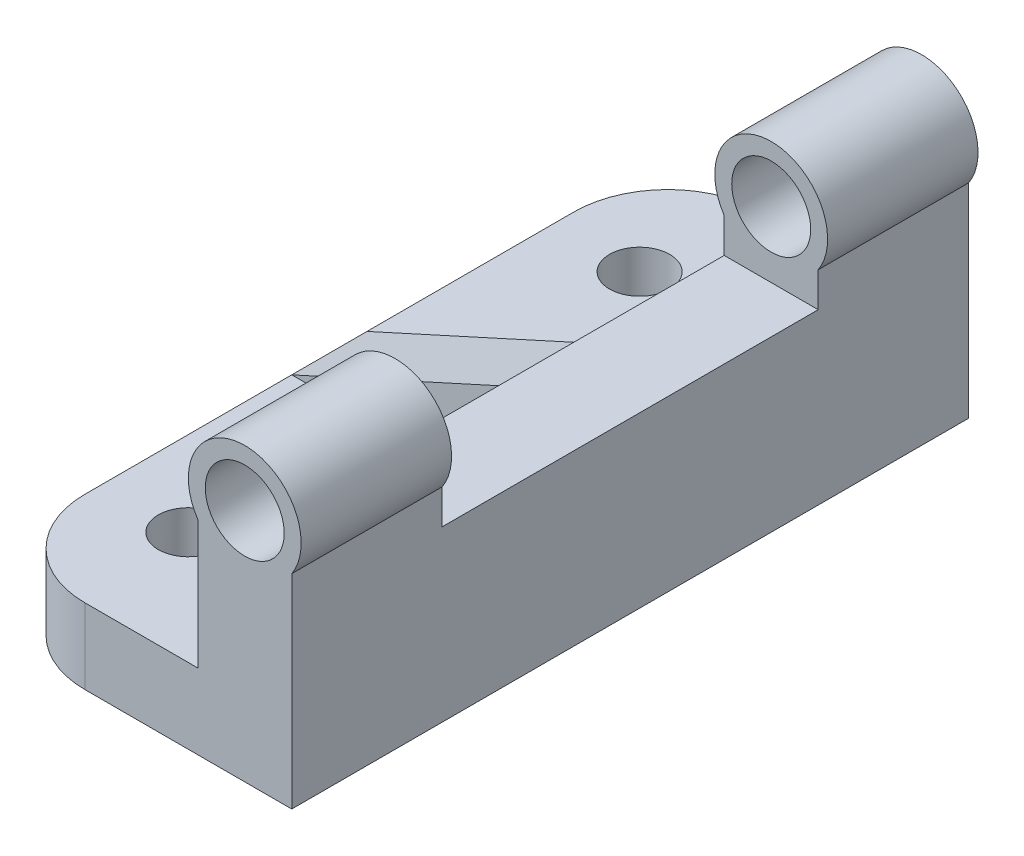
ISO-10303-21;
HEADER;
FILE_DESCRIPTION(('STEP AP214'),'2;1');
FILE_NAME('part.step','',(''),(''),'','','');
FILE_SCHEMA(('AUTOMOTIVE_DESIGN { 1 0 10303 214 1 1 1 1 }'));
ENDSEC;
DATA;
#1=APPLICATION_CONTEXT('core data for automotive mechanical design processes');
#2=APPLICATION_PROTOCOL_DEFINITION('international standard','automotive_design',2000,#1);
#3=PRODUCT_CONTEXT('',#1,'mechanical');
#4=PRODUCT('Part','Part','',(#3));
#5=PRODUCT_RELATED_PRODUCT_CATEGORY('part','',(#4));
#6=PRODUCT_DEFINITION_FORMATION('','',#4);
#7=PRODUCT_DEFINITION_CONTEXT('part definition',#1,'design');
#8=PRODUCT_DEFINITION('design','',#6,#7);
#9=PRODUCT_DEFINITION_SHAPE('','',#8);
#10=(LENGTH_UNIT() NAMED_UNIT(*) SI_UNIT(.MILLI.,.METRE.));
#11=(NAMED_UNIT(*) PLANE_ANGLE_UNIT() SI_UNIT($,.RADIAN.));
#12=(NAMED_UNIT(*) SI_UNIT($,.STERADIAN.) SOLID_ANGLE_UNIT());
#13=UNCERTAINTY_MEASURE_WITH_UNIT(LENGTH_MEASURE(1.E-05),#10,'distance_accuracy_value','');
#14=(GEOMETRIC_REPRESENTATION_CONTEXT(3) GLOBAL_UNCERTAINTY_ASSIGNED_CONTEXT((#13)) GLOBAL_UNIT_ASSIGNED_CONTEXT((#10,
#11,#12)) REPRESENTATION_CONTEXT('',''));
#15=CARTESIAN_POINT('',(0.,0.,0.));
#16=DIRECTION('',(0.,0.,1.));
#17=DIRECTION('',(1.,0.,0.));
#18=AXIS2_PLACEMENT_3D('',#15,#16,#17);
#19=CARTESIAN_POINT('',(0.,12.5,0.));
#20=DIRECTION('',(1.,0.,0.));
#21=DIRECTION('',(0.,0.,-1.));
#22=AXIS2_PLACEMENT_3D('',#19,#20,#21);
#23=PLANE('',#22);
#24=DIRECTION('',(0.,1.,0.));
#25=VECTOR('',#24,1.);
#26=CARTESIAN_POINT('',(0.,4.,2.));
#27=LINE('',#26,#25);
#28=CARTESIAN_POINT('',(0.,4.,2.));
#29=VERTEX_POINT('',#28);
#30=CARTESIAN_POINT('',(0.,9.00000000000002,2.));
#31=VERTEX_POINT('',#30);
#32=EDGE_CURVE('E174',#29,#31,#27,.T.);
#33=ORIENTED_EDGE('',*,*,#32,.F.);
#34=DIRECTION('',(0.,0.,1.));
#35=VECTOR('',#34,1.);
#36=CARTESIAN_POINT('',(0.,4.,0.));
#37=LINE('',#36,#35);
#38=CARTESIAN_POINT('',(0.,4.,18.));
#39=VERTEX_POINT('',#38);
#40=EDGE_CURVE('E180',#29,#39,#37,.T.);
#41=ORIENTED_EDGE('',*,*,#40,.T.);
#42=DIRECTION('',(0.,-1.,0.));
#43=VECTOR('',#42,1.);
#44=CARTESIAN_POINT('',(0.,12.5,18.));
#45=LINE('',#44,#43);
#46=CARTESIAN_POINT('',(0.,10.8416876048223,18.));
#47=VERTEX_POINT('',#46);
#48=EDGE_CURVE('E265',#47,#39,#45,.T.);
#49=ORIENTED_EDGE('',*,*,#48,.F.);
#50=DIRECTION('',(0.,0.,1.));
#51=VECTOR('',#50,1.);
#52=CARTESIAN_POINT('',(0.,10.8416876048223,-18.));
#53=LINE('',#52,#51);
#54=CARTESIAN_POINT('',(0.,10.8416876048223,10.));
#55=VERTEX_POINT('',#54);
#56=EDGE_CURVE('E272',#47,#55,#53,.F.);
#57=ORIENTED_EDGE('',*,*,#56,.T.);
#58=DIRECTION('',(0.,-1.,0.));
#59=VECTOR('',#58,1.);
#60=CARTESIAN_POINT('',(0.,12.5,10.));
#61=LINE('',#60,#59);
#62=CARTESIAN_POINT('',(0.,9.00000000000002,10.));
#63=VERTEX_POINT('',#62);
#64=EDGE_CURVE('E210',#55,#63,#61,.T.);
#65=ORIENTED_EDGE('',*,*,#64,.T.);
#66=DIRECTION('',(0.,0.,1.));
#67=VECTOR('',#66,1.);
#68=CARTESIAN_POINT('',(0.,9.00000000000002,0.));
#69=LINE('',#68,#67);
#70=EDGE_CURVE('E275',#31,#63,#69,.T.);
#71=ORIENTED_EDGE('',*,*,#70,.F.);
#72=EDGE_LOOP('',(#33,#41,#49,#57,#65,#71));
#73=FACE_BOUND('',#72,.T.);
#74=ADVANCED_FACE('F38',(#73),#23,.F.);
#75=CARTESIAN_POINT('',(0.,4.,0.));
#76=DIRECTION('',(0.,1.,0.));
#77=DIRECTION('',(0.,0.,1.));
#78=AXIS2_PLACEMENT_3D('',#75,#76,#77);
#79=PLANE('',#78);
#80=CARTESIAN_POINT('',(-6.5,4.,12.));
#81=DIRECTION('',(0.,1.,0.));
#82=DIRECTION('',(0.,0.,1.));
#83=AXIS2_PLACEMENT_3D('',#80,#81,#82);
#84=CIRCLE('',#83,1.6);
#85=CARTESIAN_POINT('',(-6.5,4.,13.6));
#86=VERTEX_POINT('',#85);
#87=EDGE_CURVE('E232',#86,#86,#84,.T.);
#88=ORIENTED_EDGE('',*,*,#87,.F.);
#89=EDGE_LOOP('',(#88));
#90=FACE_BOUND('',#89,.T.);
#91=DIRECTION('',(0.,0.,-1.));
#92=VECTOR('',#91,1.);
#93=CARTESIAN_POINT('',(-11.,4.,-18.));
#94=LINE('',#93,#92);
#95=CARTESIAN_POINT('',(-11.,4.,13.));
#96=VERTEX_POINT('',#95);
#97=CARTESIAN_POINT('',(-11.,4.,2.));
#98=VERTEX_POINT('',#97);
#99=EDGE_CURVE('E144',#96,#98,#94,.T.);
#100=ORIENTED_EDGE('',*,*,#99,.F.);
#101=CARTESIAN_POINT('',(-6.,4.,13.));
#102=DIRECTION('',(0.,1.,0.));
#103=DIRECTION('',(0.,0.,1.));
#104=AXIS2_PLACEMENT_3D('',#101,#102,#103);
#105=CIRCLE('',#104,5.);
#106=CARTESIAN_POINT('',(-6.,4.,18.));
#107=VERTEX_POINT('',#106);
#108=EDGE_CURVE('E291',#96,#107,#105,.T.);
#109=ORIENTED_EDGE('',*,*,#108,.T.);
#110=DIRECTION('',(-1.,0.,0.));
#111=VECTOR('',#110,1.);
#112=CARTESIAN_POINT('',(-11.,4.,18.));
#113=LINE('',#112,#111);
#114=EDGE_CURVE('E245',#39,#107,#113,.T.);
#115=ORIENTED_EDGE('',*,*,#114,.F.);
#116=ORIENTED_EDGE('',*,*,#40,.F.);
#117=DIRECTION('',(1.,0.,0.));
#118=VECTOR('',#117,1.);
#119=CARTESIAN_POINT('',(-11.,4.,2.));
#120=LINE('',#119,#118);
#121=EDGE_CURVE('E172',#98,#29,#120,.T.);
#122=ORIENTED_EDGE('',*,*,#121,.F.);
#123=EDGE_LOOP('',(#100,#109,#115,#116,#122));
#124=FACE_BOUND('',#123,.T.);
#125=ADVANCED_FACE('F178',(#90,#124),#79,.T.);
#126=CARTESIAN_POINT('',(2.5,12.5,-18.));
#127=DIRECTION('',(0.,0.,1.));
#128=DIRECTION('',(1.,0.,0.));
#129=AXIS2_PLACEMENT_3D('',#126,#127,#128);
#130=CYLINDRICAL_SURFACE('',#129,3.);
#131=CARTESIAN_POINT('',(2.5,12.5,10.));
#132=DIRECTION('',(0.,0.,1.));
#133=DIRECTION('',(1.,0.,0.));
#134=AXIS2_PLACEMENT_3D('',#131,#132,#133);
#135=CIRCLE('',#134,3.);
#136=CARTESIAN_POINT('',(5.,10.8416876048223,10.));
#137=VERTEX_POINT('',#136);
#138=EDGE_CURVE('E208',#55,#137,#135,.F.);
#139=ORIENTED_EDGE('',*,*,#138,.F.);
#140=ORIENTED_EDGE('',*,*,#56,.F.);
#141=CARTESIAN_POINT('',(2.5,12.5,18.));
#142=DIRECTION('',(0.,0.,1.));
#143=DIRECTION('',(1.,0.,0.));
#144=AXIS2_PLACEMENT_3D('',#141,#142,#143);
#145=CIRCLE('',#144,3.);
#146=CARTESIAN_POINT('',(5.,10.8416876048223,18.));
#147=VERTEX_POINT('',#146);
#148=EDGE_CURVE('E226',#147,#47,#145,.T.);
#149=ORIENTED_EDGE('',*,*,#148,.F.);
#150=DIRECTION('',(0.,0.,1.));
#151=VECTOR('',#150,1.);
#152=CARTESIAN_POINT('',(5.,10.8416876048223,-18.));
#153=LINE('',#152,#151);
#154=EDGE_CURVE('E225',#137,#147,#153,.T.);
#155=ORIENTED_EDGE('',*,*,#154,.F.);
#156=EDGE_LOOP('',(#139,#140,#149,#155));
#157=FACE_BOUND('',#156,.T.);
#158=ADVANCED_FACE('F313',(#157),#130,.T.);
#159=CARTESIAN_POINT('',(2.5,12.5,-21.));
#160=DIRECTION('',(0.,0.,1.));
#161=DIRECTION('',(1.,0.,0.));
#162=AXIS2_PLACEMENT_3D('',#159,#160,#161);
#163=CYLINDRICAL_SURFACE('',#162,2.1);
#164=CARTESIAN_POINT('',(2.5,12.5,10.));
#165=DIRECTION('',(0.,0.,1.));
#166=DIRECTION('',(1.,0.,0.));
#167=AXIS2_PLACEMENT_3D('',#164,#165,#166);
#168=CIRCLE('',#167,2.1);
#169=CARTESIAN_POINT('',(4.6,12.5,10.));
#170=VERTEX_POINT('',#169);
#171=EDGE_CURVE('E207',#170,#170,#168,.F.);
#172=ORIENTED_EDGE('',*,*,#171,.T.);
#173=EDGE_LOOP('',(#172));
#174=FACE_BOUND('',#173,.T.);
#175=CARTESIAN_POINT('',(2.5,12.5,18.));
#176=DIRECTION('',(0.,0.,1.));
#177=DIRECTION('',(1.,0.,0.));
#178=AXIS2_PLACEMENT_3D('',#175,#176,#177);
#179=CIRCLE('',#178,2.1);
#180=CARTESIAN_POINT('',(4.6,12.5,18.));
#181=VERTEX_POINT('',#180);
#182=EDGE_CURVE('E218',#181,#181,#179,.T.);
#183=ORIENTED_EDGE('',*,*,#182,.T.);
#184=EDGE_LOOP('',(#183));
#185=FACE_BOUND('',#184,.T.);
#186=ADVANCED_FACE('F375',(#174,#185),#163,.F.);
#187=CARTESIAN_POINT('',(5.,12.5,18.));
#188=DIRECTION('',(0.,0.,-1.));
#189=DIRECTION('',(-1.,0.,0.));
#190=AXIS2_PLACEMENT_3D('',#187,#188,#189);
#191=PLANE('',#190);
#192=ORIENTED_EDGE('',*,*,#182,.F.);
#193=EDGE_LOOP('',(#192));
#194=FACE_BOUND('',#193,.T.);
#195=ORIENTED_EDGE('',*,*,#114,.T.);
#196=DIRECTION('',(0.,-1.,0.));
#197=VECTOR('',#196,1.);
#198=CARTESIAN_POINT('',(-6.,0.,18.));
#199=LINE('',#198,#197);
#200=CARTESIAN_POINT('',(-6.,0.,18.));
#201=VERTEX_POINT('',#200);
#202=EDGE_CURVE('E285',#107,#201,#199,.T.);
#203=ORIENTED_EDGE('',*,*,#202,.T.);
#204=DIRECTION('',(1.,0.,0.));
#205=VECTOR('',#204,1.);
#206=CARTESIAN_POINT('',(5.,0.,18.));
#207=LINE('',#206,#205);
#208=CARTESIAN_POINT('',(5.,0.,18.));
#209=VERTEX_POINT('',#208);
#210=EDGE_CURVE('E249',#201,#209,#207,.T.);
#211=ORIENTED_EDGE('',*,*,#210,.T.);
#212=DIRECTION('',(0.,-1.,0.));
#213=VECTOR('',#212,1.);
#214=CARTESIAN_POINT('',(5.,12.5,18.));
#215=LINE('',#214,#213);
#216=EDGE_CURVE('E262',#147,#209,#215,.T.);
#217=ORIENTED_EDGE('',*,*,#216,.F.);
#218=ORIENTED_EDGE('',*,*,#148,.T.);
#219=ORIENTED_EDGE('',*,*,#48,.T.);
#220=EDGE_LOOP('',(#195,#203,#211,#217,#218,#219));
#221=FACE_BOUND('',#220,.T.);
#222=ADVANCED_FACE('F306',(#194,#221),#191,.F.);
#223=CARTESIAN_POINT('',(5.,12.5,-18.));
#224=DIRECTION('',(-1.,0.,0.));
#225=DIRECTION('',(0.,0.,1.));
#226=AXIS2_PLACEMENT_3D('',#223,#224,#225);
#227=PLANE('',#226);
#228=DIRECTION('',(0.,0.,-1.));
#229=VECTOR('',#228,1.);
#230=CARTESIAN_POINT('',(5.,9.00000000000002,-18.));
#231=LINE('',#230,#229);
#232=CARTESIAN_POINT('',(5.,9.00000000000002,10.));
#233=VERTEX_POINT('',#232);
#234=CARTESIAN_POINT('',(5.,9.00000000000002,-10.));
#235=VERTEX_POINT('',#234);
#236=EDGE_CURVE('E216',#233,#235,#231,.T.);
#237=ORIENTED_EDGE('',*,*,#236,.F.);
#238=DIRECTION('',(0.,1.,0.));
#239=VECTOR('',#238,1.);
#240=CARTESIAN_POINT('',(5.,12.5,10.));
#241=LINE('',#240,#239);
#242=EDGE_CURVE('E213',#233,#137,#241,.T.);
#243=ORIENTED_EDGE('',*,*,#242,.T.);
#244=ORIENTED_EDGE('',*,*,#154,.T.);
#245=ORIENTED_EDGE('',*,*,#216,.T.);
#246=DIRECTION('',(0.,0.,-1.));
#247=VECTOR('',#246,1.);
#248=CARTESIAN_POINT('',(5.,0.,-18.));
#249=LINE('',#248,#247);
#250=CARTESIAN_POINT('',(5.,0.,-18.));
#251=VERTEX_POINT('',#250);
#252=EDGE_CURVE('E252',#209,#251,#249,.T.);
#253=ORIENTED_EDGE('',*,*,#252,.T.);
#254=DIRECTION('',(0.,-1.,0.));
#255=VECTOR('',#254,1.);
#256=CARTESIAN_POINT('',(5.,12.5,-18.));
#257=LINE('',#256,#255);
#258=CARTESIAN_POINT('',(5.,10.8416876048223,-18.));
#259=VERTEX_POINT('',#258);
#260=EDGE_CURVE('E260',#259,#251,#257,.T.);
#261=ORIENTED_EDGE('',*,*,#260,.F.);
#262=CARTESIAN_POINT('',(5.,10.8416876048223,-10.));
#263=VERTEX_POINT('',#262);
#264=EDGE_CURVE('E229',#259,#263,#153,.T.);
#265=ORIENTED_EDGE('',*,*,#264,.T.);
#266=DIRECTION('',(0.,-1.,0.));
#267=VECTOR('',#266,1.);
#268=CARTESIAN_POINT('',(5.,12.5,-10.));
#269=LINE('',#268,#267);
#270=EDGE_CURVE('E204',#263,#235,#269,.T.);
#271=ORIENTED_EDGE('',*,*,#270,.T.);
#272=EDGE_LOOP('',(#237,#243,#244,#245,#253,#261,#265,#271));
#273=FACE_BOUND('',#272,.T.);
#274=ADVANCED_FACE('F320',(#273),#227,.F.);
#275=CARTESIAN_POINT('',(0.,12.5,-18.));
#276=DIRECTION('',(0.,0.,1.));
#277=DIRECTION('',(1.,0.,0.));
#278=AXIS2_PLACEMENT_3D('',#275,#276,#277);
#279=PLANE('',#278);
#280=CARTESIAN_POINT('',(2.5,12.5,-18.));
#281=DIRECTION('',(0.,0.,1.));
#282=DIRECTION('',(1.,0.,0.));
#283=AXIS2_PLACEMENT_3D('',#280,#281,#282);
#284=CIRCLE('',#283,2.1);
#285=CARTESIAN_POINT('',(4.6,12.5,-18.));
#286=VERTEX_POINT('',#285);
#287=EDGE_CURVE('E221',#286,#286,#284,.T.);
#288=ORIENTED_EDGE('',*,*,#287,.T.);
#289=EDGE_LOOP('',(#288));
#290=FACE_BOUND('',#289,.T.);
#291=DIRECTION('',(-1.,0.,0.));
#292=VECTOR('',#291,1.);
#293=CARTESIAN_POINT('',(0.,0.,-18.));
#294=LINE('',#293,#292);
#295=CARTESIAN_POINT('',(-5.99999999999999,0.,-18.));
#296=VERTEX_POINT('',#295);
#297=EDGE_CURVE('E255',#251,#296,#294,.T.);
#298=ORIENTED_EDGE('',*,*,#297,.T.);
#299=DIRECTION('',(0.,-1.,0.));
#300=VECTOR('',#299,1.);
#301=CARTESIAN_POINT('',(-5.99999999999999,4.,-18.));
#302=LINE('',#301,#300);
#303=CARTESIAN_POINT('',(-5.99999999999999,4.,-18.));
#304=VERTEX_POINT('',#303);
#305=EDGE_CURVE('E46',#296,#304,#302,.F.);
#306=ORIENTED_EDGE('',*,*,#305,.T.);
#307=DIRECTION('',(1.,0.,0.));
#308=VECTOR('',#307,1.);
#309=CARTESIAN_POINT('',(5.,4.,-18.));
#310=LINE('',#309,#308);
#311=CARTESIAN_POINT('',(0.,4.,-18.));
#312=VERTEX_POINT('',#311);
#313=EDGE_CURVE('E155',#304,#312,#310,.T.);
#314=ORIENTED_EDGE('',*,*,#313,.T.);
#315=DIRECTION('',(0.,-1.,0.));
#316=VECTOR('',#315,1.);
#317=CARTESIAN_POINT('',(0.,12.5,-18.));
#318=LINE('',#317,#316);
#319=CARTESIAN_POINT('',(0.,10.8416876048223,-18.));
#320=VERTEX_POINT('',#319);
#321=EDGE_CURVE('E257',#320,#312,#318,.T.);
#322=ORIENTED_EDGE('',*,*,#321,.F.);
#323=CARTESIAN_POINT('',(2.5,12.5,-18.));
#324=DIRECTION('',(0.,0.,1.));
#325=DIRECTION('',(1.,0.,0.));
#326=AXIS2_PLACEMENT_3D('',#323,#324,#325);
#327=CIRCLE('',#326,3.);
#328=EDGE_CURVE('E222',#259,#320,#327,.T.);
#329=ORIENTED_EDGE('',*,*,#328,.F.);
#330=ORIENTED_EDGE('',*,*,#260,.T.);
#331=EDGE_LOOP('',(#298,#306,#314,#322,#329,#330));
#332=FACE_BOUND('',#331,.T.);
#333=ADVANCED_FACE('F336',(#290,#332),#279,.F.);
#334=CARTESIAN_POINT('',(0.,4.,-2.));
#335=VERTEX_POINT('',#334);
#336=EDGE_CURVE('E268',#312,#335,#37,.T.);
#337=ORIENTED_EDGE('',*,*,#336,.T.);
#338=DIRECTION('',(0.,1.,0.));
#339=VECTOR('',#338,1.);
#340=CARTESIAN_POINT('',(0.,4.,-2.));
#341=LINE('',#340,#339);
#342=CARTESIAN_POINT('',(0.,9.,-2.));
#343=VERTEX_POINT('',#342);
#344=EDGE_CURVE('E168',#335,#343,#341,.T.);
#345=ORIENTED_EDGE('',*,*,#344,.T.);
#346=CARTESIAN_POINT('',(0.,9.00000000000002,-10.));
#347=VERTEX_POINT('',#346);
#348=EDGE_CURVE('E282',#347,#343,#69,.T.);
#349=ORIENTED_EDGE('',*,*,#348,.F.);
#350=DIRECTION('',(0.,1.,0.));
#351=VECTOR('',#350,1.);
#352=CARTESIAN_POINT('',(0.,12.5,-10.));
#353=LINE('',#352,#351);
#354=CARTESIAN_POINT('',(0.,10.8416876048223,-10.));
#355=VERTEX_POINT('',#354);
#356=EDGE_CURVE('E201',#347,#355,#353,.T.);
#357=ORIENTED_EDGE('',*,*,#356,.T.);
#358=EDGE_CURVE('E271',#355,#320,#53,.F.);
#359=ORIENTED_EDGE('',*,*,#358,.T.);
#360=ORIENTED_EDGE('',*,*,#321,.T.);
#361=EDGE_LOOP('',(#337,#345,#349,#357,#359,#360));
#362=FACE_BOUND('',#361,.T.);
#363=ADVANCED_FACE('F330',(#362),#23,.F.);
#364=CARTESIAN_POINT('',(0.,0.,0.));
#365=DIRECTION('',(0.,-1.,0.));
#366=DIRECTION('',(0.,0.,-1.));
#367=AXIS2_PLACEMENT_3D('',#364,#365,#366);
#368=PLANE('',#367);
#369=CARTESIAN_POINT('',(-6.5,0.,-12.));
#370=DIRECTION('',(0.,-1.,0.));
#371=DIRECTION('',(0.,0.,-1.));
#372=AXIS2_PLACEMENT_3D('',#369,#370,#371);
#373=CIRCLE('',#372,1.6);
#374=CARTESIAN_POINT('',(-6.5,0.,-13.6));
#375=VERTEX_POINT('',#374);
#376=EDGE_CURVE('E241',#375,#375,#373,.T.);
#377=ORIENTED_EDGE('',*,*,#376,.F.);
#378=EDGE_LOOP('',(#377));
#379=FACE_BOUND('',#378,.T.);
#380=CARTESIAN_POINT('',(-6.5,0.,12.));
#381=DIRECTION('',(0.,-1.,0.));
#382=DIRECTION('',(0.,0.,-1.));
#383=AXIS2_PLACEMENT_3D('',#380,#381,#382);
#384=CIRCLE('',#383,1.6);
#385=CARTESIAN_POINT('',(-6.5,0.,10.4));
#386=VERTEX_POINT('',#385);
#387=EDGE_CURVE('E236',#386,#386,#384,.T.);
#388=ORIENTED_EDGE('',*,*,#387,.F.);
#389=EDGE_LOOP('',(#388));
#390=FACE_BOUND('',#389,.T.);
#391=DIRECTION('',(0.,0.,-1.));
#392=VECTOR('',#391,1.);
#393=CARTESIAN_POINT('',(-11.,0.,-18.));
#394=LINE('',#393,#392);
#395=CARTESIAN_POINT('',(-11.,0.,13.));
#396=VERTEX_POINT('',#395);
#397=CARTESIAN_POINT('',(-11.,0.,-13.));
#398=VERTEX_POINT('',#397);
#399=EDGE_CURVE('E244',#396,#398,#394,.T.);
#400=ORIENTED_EDGE('',*,*,#399,.T.);
#401=CARTESIAN_POINT('',(-5.99999999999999,0.,-13.));
#402=DIRECTION('',(0.,-1.,0.));
#403=DIRECTION('',(0.,0.,-1.));
#404=AXIS2_PLACEMENT_3D('',#401,#402,#403);
#405=CIRCLE('',#404,5.);
#406=EDGE_CURVE('E60',#398,#296,#405,.T.);
#407=ORIENTED_EDGE('',*,*,#406,.T.);
#408=ORIENTED_EDGE('',*,*,#297,.F.);
#409=ORIENTED_EDGE('',*,*,#252,.F.);
#410=ORIENTED_EDGE('',*,*,#210,.F.);
#411=CARTESIAN_POINT('',(-6.,0.,13.));
#412=DIRECTION('',(0.,-1.,0.));
#413=DIRECTION('',(0.,0.,-1.));
#414=AXIS2_PLACEMENT_3D('',#411,#412,#413);
#415=CIRCLE('',#414,5.);
#416=EDGE_CURVE('E288',#201,#396,#415,.T.);
#417=ORIENTED_EDGE('',*,*,#416,.T.);
#418=EDGE_LOOP('',(#400,#407,#408,#409,#410,#417));
#419=FACE_BOUND('',#418,.T.);
#420=ADVANCED_FACE('F299',(#379,#390,#419),#368,.T.);
#421=ORIENTED_EDGE('',*,*,#313,.F.);
#422=CARTESIAN_POINT('',(-5.99999999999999,4.,-13.));
#423=DIRECTION('',(0.,1.,0.));
#424=DIRECTION('',(0.,0.,1.));
#425=AXIS2_PLACEMENT_3D('',#422,#423,#424);
#426=CIRCLE('',#425,5.);
#427=CARTESIAN_POINT('',(-11.,4.,-13.));
#428=VERTEX_POINT('',#427);
#429=EDGE_CURVE('E11',#304,#428,#426,.T.);
#430=ORIENTED_EDGE('',*,*,#429,.T.);
#431=CARTESIAN_POINT('',(-11.,4.,-2.));
#432=VERTEX_POINT('',#431);
#433=EDGE_CURVE('E156',#432,#428,#94,.T.);
#434=ORIENTED_EDGE('',*,*,#433,.F.);
#435=DIRECTION('',(1.,0.,0.));
#436=VECTOR('',#435,1.);
#437=CARTESIAN_POINT('',(-11.,4.,-2.));
#438=LINE('',#437,#436);
#439=EDGE_CURVE('E185',#432,#335,#438,.T.);
#440=ORIENTED_EDGE('',*,*,#439,.T.);
#441=ORIENTED_EDGE('',*,*,#336,.F.);
#442=EDGE_LOOP('',(#421,#430,#434,#440,#441));
#443=FACE_BOUND('',#442,.T.);
#444=CARTESIAN_POINT('',(-6.5,4.,-12.));
#445=DIRECTION('',(0.,1.,0.));
#446=DIRECTION('',(0.,0.,1.));
#447=AXIS2_PLACEMENT_3D('',#444,#445,#446);
#448=CIRCLE('',#447,1.6);
#449=CARTESIAN_POINT('',(-6.5,4.,-10.4));
#450=VERTEX_POINT('',#449);
#451=EDGE_CURVE('E233',#450,#450,#448,.T.);
#452=ORIENTED_EDGE('',*,*,#451,.F.);
#453=EDGE_LOOP('',(#452));
#454=FACE_BOUND('',#453,.T.);
#455=ADVANCED_FACE('F339',(#443,#454),#79,.T.);
#456=CARTESIAN_POINT('',(-11.,4.,-18.));
#457=DIRECTION('',(-1.,0.,0.));
#458=DIRECTION('',(0.,0.,1.));
#459=AXIS2_PLACEMENT_3D('',#456,#457,#458);
#460=PLANE('',#459);
#461=ORIENTED_EDGE('',*,*,#433,.T.);
#462=DIRECTION('',(0.,-1.,0.));
#463=VECTOR('',#462,1.);
#464=CARTESIAN_POINT('',(-11.,0.,-13.));
#465=LINE('',#464,#463);
#466=EDGE_CURVE('E293',#428,#398,#465,.T.);
#467=ORIENTED_EDGE('',*,*,#466,.T.);
#468=ORIENTED_EDGE('',*,*,#399,.F.);
#469=DIRECTION('',(0.,-1.,0.));
#470=VECTOR('',#469,1.);
#471=CARTESIAN_POINT('',(-11.,4.,13.));
#472=LINE('',#471,#470);
#473=EDGE_CURVE('E151',#396,#96,#472,.F.);
#474=ORIENTED_EDGE('',*,*,#473,.T.);
#475=ORIENTED_EDGE('',*,*,#99,.T.);
#476=DIRECTION('',(0.,0.,1.));
#477=VECTOR('',#476,1.);
#478=CARTESIAN_POINT('',(-11.,4.,-2.));
#479=LINE('',#478,#477);
#480=EDGE_CURVE('E148',#432,#98,#479,.T.);
#481=ORIENTED_EDGE('',*,*,#480,.F.);
#482=EDGE_LOOP('',(#461,#467,#468,#474,#475,#481));
#483=FACE_BOUND('',#482,.T.);
#484=ADVANCED_FACE('F147',(#483),#460,.T.);
#485=CARTESIAN_POINT('',(-6.5,-5.,12.));
#486=DIRECTION('',(0.,1.,0.));
#487=DIRECTION('',(0.,0.,1.));
#488=AXIS2_PLACEMENT_3D('',#485,#486,#487);
#489=CYLINDRICAL_SURFACE('',#488,1.6);
#490=ORIENTED_EDGE('',*,*,#387,.T.);
#491=EDGE_LOOP('',(#490));
#492=FACE_BOUND('',#491,.T.);
#493=ORIENTED_EDGE('',*,*,#87,.T.);
#494=EDGE_LOOP('',(#493));
#495=FACE_BOUND('',#494,.T.);
#496=ADVANCED_FACE('F457',(#492,#495),#489,.F.);
#497=CARTESIAN_POINT('',(-6.5,-5.,-12.));
#498=DIRECTION('',(0.,1.,0.));
#499=DIRECTION('',(0.,0.,1.));
#500=AXIS2_PLACEMENT_3D('',#497,#498,#499);
#501=CYLINDRICAL_SURFACE('',#500,1.6);
#502=ORIENTED_EDGE('',*,*,#376,.T.);
#503=EDGE_LOOP('',(#502));
#504=FACE_BOUND('',#503,.T.);
#505=ORIENTED_EDGE('',*,*,#451,.T.);
#506=EDGE_LOOP('',(#505));
#507=FACE_BOUND('',#506,.T.);
#508=ADVANCED_FACE('F447',(#504,#507),#501,.F.);
#509=CARTESIAN_POINT('',(2.5,12.5,-10.));
#510=DIRECTION('',(0.,0.,-1.));
#511=DIRECTION('',(-1.,0.,0.));
#512=AXIS2_PLACEMENT_3D('',#509,#510,#511);
#513=CIRCLE('',#512,3.);
#514=EDGE_CURVE('E199',#263,#355,#513,.F.);
#515=ORIENTED_EDGE('',*,*,#514,.F.);
#516=ORIENTED_EDGE('',*,*,#264,.F.);
#517=ORIENTED_EDGE('',*,*,#328,.T.);
#518=ORIENTED_EDGE('',*,*,#358,.F.);
#519=EDGE_LOOP('',(#515,#516,#517,#518));
#520=FACE_BOUND('',#519,.T.);
#521=ADVANCED_FACE('F333',(#520),#130,.T.);
#522=CARTESIAN_POINT('',(2.5,12.5,-10.));
#523=DIRECTION('',(0.,0.,-1.));
#524=DIRECTION('',(-1.,0.,0.));
#525=AXIS2_PLACEMENT_3D('',#522,#523,#524);
#526=CIRCLE('',#525,2.1);
#527=CARTESIAN_POINT('',(0.400000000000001,12.5,-10.));
#528=VERTEX_POINT('',#527);
#529=EDGE_CURVE('E198',#528,#528,#526,.F.);
#530=ORIENTED_EDGE('',*,*,#529,.T.);
#531=EDGE_LOOP('',(#530));
#532=FACE_BOUND('',#531,.T.);
#533=ORIENTED_EDGE('',*,*,#287,.F.);
#534=EDGE_LOOP('',(#533));
#535=FACE_BOUND('',#534,.T.);
#536=ADVANCED_FACE('F432',(#532,#535),#163,.F.);
#537=CARTESIAN_POINT('',(0.,9.00000000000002,0.));
#538=DIRECTION('',(0.,1.,0.));
#539=DIRECTION('',(0.,0.,1.));
#540=AXIS2_PLACEMENT_3D('',#537,#538,#539);
#541=PLANE('',#540);
#542=ORIENTED_EDGE('',*,*,#236,.T.);
#543=DIRECTION('',(-1.,0.,0.));
#544=VECTOR('',#543,1.);
#545=CARTESIAN_POINT('',(7.35256298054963,9.00000000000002,-10.));
#546=LINE('',#545,#544);
#547=EDGE_CURVE('E191',#235,#347,#546,.T.);
#548=ORIENTED_EDGE('',*,*,#547,.T.);
#549=ORIENTED_EDGE('',*,*,#348,.T.);
#550=DIRECTION('',(0.,0.,1.));
#551=VECTOR('',#550,1.);
#552=CARTESIAN_POINT('',(0.,9.,-2.));
#553=LINE('',#552,#551);
#554=EDGE_CURVE('E167',#343,#31,#553,.T.);
#555=ORIENTED_EDGE('',*,*,#554,.T.);
#556=ORIENTED_EDGE('',*,*,#70,.T.);
#557=DIRECTION('',(1.,0.,0.));
#558=VECTOR('',#557,1.);
#559=CARTESIAN_POINT('',(-2.13153016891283,9.00000000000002,10.));
#560=LINE('',#559,#558);
#561=EDGE_CURVE('E195',#63,#233,#560,.T.);
#562=ORIENTED_EDGE('',*,*,#561,.T.);
#563=EDGE_LOOP('',(#542,#548,#549,#555,#556,#562));
#564=FACE_BOUND('',#563,.T.);
#565=ADVANCED_FACE('F323',(#564),#541,.T.);
#566=CARTESIAN_POINT('',(-2.13153016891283,9.00000000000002,10.));
#567=DIRECTION('',(0.,0.,1.));
#568=DIRECTION('',(1.,0.,0.));
#569=AXIS2_PLACEMENT_3D('',#566,#567,#568);
#570=PLANE('',#569);
#571=ORIENTED_EDGE('',*,*,#171,.F.);
#572=EDGE_LOOP('',(#571));
#573=FACE_BOUND('',#572,.T.);
#574=ORIENTED_EDGE('',*,*,#561,.F.);
#575=ORIENTED_EDGE('',*,*,#64,.F.);
#576=ORIENTED_EDGE('',*,*,#138,.T.);
#577=ORIENTED_EDGE('',*,*,#242,.F.);
#578=EDGE_LOOP('',(#574,#575,#576,#577));
#579=FACE_BOUND('',#578,.T.);
#580=ADVANCED_FACE('F317',(#573,#579),#570,.F.);
#581=CARTESIAN_POINT('',(7.35256298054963,9.00000000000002,-10.));
#582=DIRECTION('',(0.,0.,-1.));
#583=DIRECTION('',(-1.,0.,0.));
#584=AXIS2_PLACEMENT_3D('',#581,#582,#583);
#585=PLANE('',#584);
#586=ORIENTED_EDGE('',*,*,#529,.F.);
#587=EDGE_LOOP('',(#586));
#588=FACE_BOUND('',#587,.T.);
#589=ORIENTED_EDGE('',*,*,#514,.T.);
#590=ORIENTED_EDGE('',*,*,#356,.F.);
#591=ORIENTED_EDGE('',*,*,#547,.F.);
#592=ORIENTED_EDGE('',*,*,#270,.F.);
#593=EDGE_LOOP('',(#589,#590,#591,#592));
#594=FACE_BOUND('',#593,.T.);
#595=ADVANCED_FACE('F326',(#588,#594),#585,.F.);
#596=CARTESIAN_POINT('',(0.,9.,-2.));
#597=DIRECTION('',(-0.413802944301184,0.910366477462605,0.));
#598=DIRECTION('',(-0.910366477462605,-0.413802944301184,0.));
#599=AXIS2_PLACEMENT_3D('',#596,#597,#598);
#600=PLANE('',#599);
#601=ORIENTED_EDGE('',*,*,#480,.T.);
#602=DIRECTION('',(-0.910366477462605,-0.413802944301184,0.));
#603=VECTOR('',#602,1.);
#604=CARTESIAN_POINT('',(0.,9.,2.));
#605=LINE('',#604,#603);
#606=EDGE_CURVE('E162',#31,#98,#605,.T.);
#607=ORIENTED_EDGE('',*,*,#606,.F.);
#608=ORIENTED_EDGE('',*,*,#554,.F.);
#609=DIRECTION('',(-0.910366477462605,-0.413802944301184,0.));
#610=VECTOR('',#609,1.);
#611=CARTESIAN_POINT('',(0.,9.,-2.));
#612=LINE('',#611,#610);
#613=EDGE_CURVE('E165',#343,#432,#612,.T.);
#614=ORIENTED_EDGE('',*,*,#613,.T.);
#615=EDGE_LOOP('',(#601,#607,#608,#614));
#616=FACE_BOUND('',#615,.T.);
#617=ADVANCED_FACE('F161',(#616),#600,.T.);
#618=CARTESIAN_POINT('',(0.,0.,-2.));
#619=DIRECTION('',(0.,0.,-1.));
#620=DIRECTION('',(-1.,0.,0.));
#621=AXIS2_PLACEMENT_3D('',#618,#619,#620);
#622=PLANE('',#621);
#623=ORIENTED_EDGE('',*,*,#613,.F.);
#624=ORIENTED_EDGE('',*,*,#344,.F.);
#625=ORIENTED_EDGE('',*,*,#439,.F.);
#626=EDGE_LOOP('',(#623,#624,#625));
#627=FACE_BOUND('',#626,.T.);
#628=ADVANCED_FACE('F342',(#627),#622,.T.);
#629=CARTESIAN_POINT('',(0.,0.,2.));
#630=DIRECTION('',(0.,0.,-1.));
#631=DIRECTION('',(-1.,0.,0.));
#632=AXIS2_PLACEMENT_3D('',#629,#630,#631);
#633=PLANE('',#632);
#634=ORIENTED_EDGE('',*,*,#606,.T.);
#635=ORIENTED_EDGE('',*,*,#121,.T.);
#636=ORIENTED_EDGE('',*,*,#32,.T.);
#637=EDGE_LOOP('',(#634,#635,#636));
#638=FACE_BOUND('',#637,.T.);
#639=ADVANCED_FACE('F171',(#638),#633,.F.);
#640=CARTESIAN_POINT('',(-6.,12.5,13.));
#641=DIRECTION('',(0.,1.,0.));
#642=DIRECTION('',(0.,0.,1.));
#643=AXIS2_PLACEMENT_3D('',#640,#641,#642);
#644=CYLINDRICAL_SURFACE('',#643,5.);
#645=ORIENTED_EDGE('',*,*,#108,.F.);
#646=ORIENTED_EDGE('',*,*,#473,.F.);
#647=ORIENTED_EDGE('',*,*,#416,.F.);
#648=ORIENTED_EDGE('',*,*,#202,.F.);
#649=EDGE_LOOP('',(#645,#646,#647,#648));
#650=FACE_BOUND('',#649,.T.);
#651=ADVANCED_FACE('F304',(#650),#644,.T.);
#652=CARTESIAN_POINT('',(-5.99999999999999,4.,-13.));
#653=DIRECTION('',(0.,1.,0.));
#654=DIRECTION('',(0.,0.,1.));
#655=AXIS2_PLACEMENT_3D('',#652,#653,#654);
#656=CYLINDRICAL_SURFACE('',#655,5.);
#657=ORIENTED_EDGE('',*,*,#429,.F.);
#658=ORIENTED_EDGE('',*,*,#305,.F.);
#659=ORIENTED_EDGE('',*,*,#406,.F.);
#660=ORIENTED_EDGE('',*,*,#466,.F.);
#661=EDGE_LOOP('',(#657,#658,#659,#660));
#662=FACE_BOUND('',#661,.T.);
#663=ADVANCED_FACE('F40',(#662),#656,.T.);
#664=CLOSED_SHELL('',(#74,#125,#158,#186,#222,#274,#333,#363,#420,#455,#484,#496,#508,#521,#536,
#565,#580,#595,#617,#628,#639,#651,#663));
#665=MANIFOLD_SOLID_BREP('B2',#664);
#666=ADVANCED_BREP_SHAPE_REPRESENTATION('',(#18,#665),#14);
#667=SHAPE_DEFINITION_REPRESENTATION(#9,#666);
ENDSEC;
END-ISO-10303-21;
